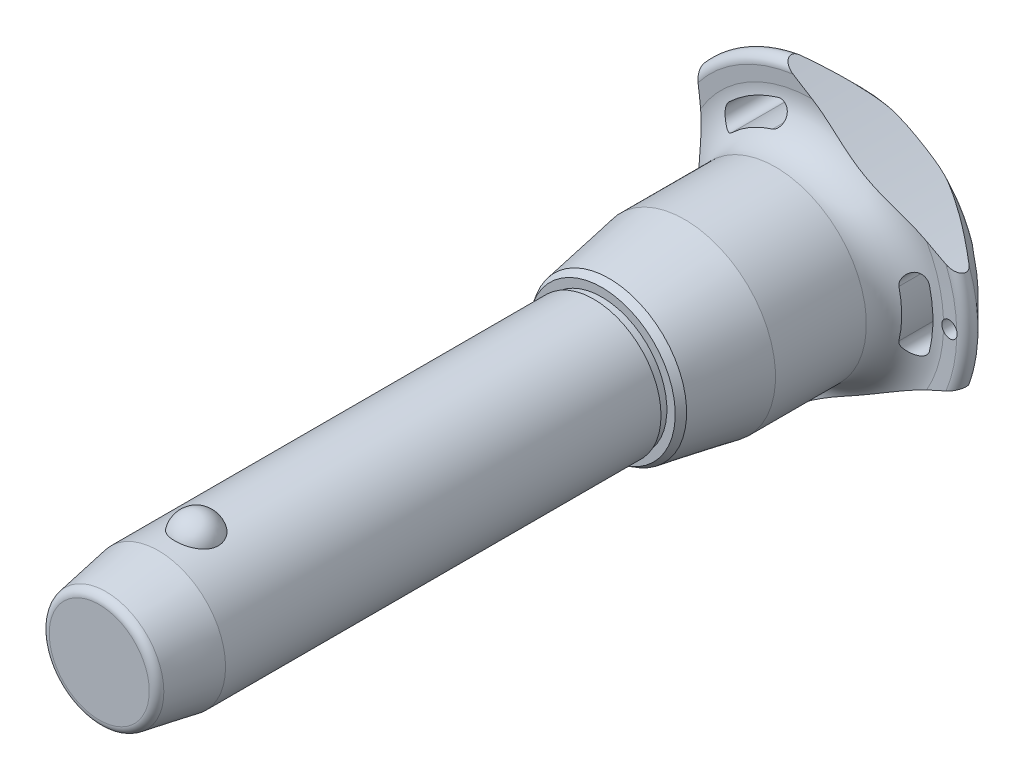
from build123d import *

# Parameters (mm, degrees)
SKETCH1_R           = 12.5
BOSS_EXTRUDE1_DEPTH = 70
SKETCH2_R           = 10
BOSS_EXTRUDE2_DEPTH = 50.7
BOSS_EXTRUDE3_START = 22
SKETCH1_2_R         = 12.5
BOSS_EXTRUDE3_DEPTH = 22
CHAMFER1_SIZE       = 11
CHAMFER1_SIZE2      = 1.939596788
FILLET1_R           = 1.5
SKETCH6_R           = 176.92625
CUT_EXTRUDE1_DEPTH  = 128.274554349
CIRPATTERN1_COUNT   = 3
SKETCH7_R           = 1.5
CUT_EXTRUDE2_DEPTH  = 128.154892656


with BuildPart() as part:
    # Sketch1 → Boss-Extrude1 (new body)
    with BuildSketch(Plane.XY):
        Circle(SKETCH1_R)
    extrude(amount=-BOSS_EXTRUDE1_DEPTH)

    # Sketch2 → Boss-Extrude2 (add)
    with BuildSketch(Plane(origin=(0, 0, -70), x_dir=(-1, 0, 0), z_dir=(0, 0, -1))):
        with Locations(Location((0, 0, 0), (0, 0, 180))):
            Circle(SKETCH2_R)
    extrude(amount=BOSS_EXTRUDE2_DEPTH)

    # Sketch3 → Revolve1 (revolve)
    with BuildSketch(Plane(origin=(0, 0, 0), x_dir=(0, 0, -1), z_dir=(1, 0, 0))):
        with BuildLine():
            Line((-3.957271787, 15.4), (-3.957271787, 7.1))
            ThreePointArc((-3.957271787, 7.1), (0.192728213, 11.25), (-3.957271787, 15.4))
        make_face()
        with BuildLine():
            Line((-3.957271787, -7.1), (-3.957271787, -15.4))
            ThreePointArc((-3.957271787, -15.4), (0.192728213, -11.25), (-3.957271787, -7.1))
        make_face()
    revolve(axis=Axis((0, -7.1, 3.957271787), (0, 1, 0)))

    # Sketch1_2 → Boss-Extrude3 (add)
    with BuildSketch(Plane.XY.offset(BOSS_EXTRUDE3_START)):
        Circle(SKETCH1_2_R)
    extrude(amount=-BOSS_EXTRUDE3_DEPTH)

    # Chamfer1
    chamfer1_edges = [part.edges().sort_by_distance(p)[0] for p in [
        (-12.5, 0, 22),
    ]]
    chamfer1_side = [part.faces().sort_by_distance(p)[0] for p in [
        (-12.5, 0, -24),
    ]]
    chamfer(chamfer1_edges, length=CHAMFER1_SIZE, length2=CHAMFER1_SIZE2, reference=chamfer1_side[0])

    # Fillet1
    fillet1_edges = [part.edges().sort_by_distance(p)[0] for p in [
        (-10.560403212, 0, 22),
        (-10, 0, -120.7),
    ]]
    fillet(fillet1_edges, radius=FILLET1_R)

    # Sketch4 → Revolve2 (revolve)
    with BuildSketch(Plane(origin=(0, 0, 0), x_dir=(0, 0, -1), z_dir=(1, 0, 0)), mode=Mode.PRIVATE) as revolve2_sk:
        Polygon((70, 0), (70, 12.089202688), (71.5, 12.089202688), (71.5, 13.644437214), (72.846872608, 14.422054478), (86.9, 16.9), (103.8, 16.9), (103.8, 0), align=None)
    revolve(revolve2_sk.sketch.rotate(Axis((0, 0, -103.8), (0, 0, 1)), 90), axis=Axis((0, 0, -103.8), (0, 0, 1)))

    # Sketch5 → Revolve3 (revolve)
    with BuildSketch(Plane(origin=(0, 0, 0), x_dir=(0, 0, -1), z_dir=(1, 0, 0)), mode=Mode.PRIVATE) as revolve3_sk:
        with BuildLine():
            Line((110.790129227, 24.271609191), (110.652256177, 26.865060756))
            ThreePointArc((110.652256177, 26.865060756), (111.598671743, 28.411427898), (113.38137085, 28.08137085))
            Line((113.38137085, 28.08137085), (119.763226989, 21.69951471))
            ThreePointArc((119.763226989, 21.69951471), (120.7, 19.381044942), (119.683055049, 17.096604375))
            ThreePointArc((119.683055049, 17.096604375), (114.18864484, 9.321268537), (112.25, 0))
            Line((112.25, 0), (103.8, 0))
            Line((103.8, 0), (103.8, 16.9))
            ThreePointArc((103.8, 16.9), (108.879432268, 19.083427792), (110.790129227, 24.271609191))
        make_face()
    revolve(revolve3_sk.sketch.rotate(Axis((0, 0, -112.25), (0, 0, 1)), 90), axis=Axis((0, 0, -112.25), (0, 0, 1)))

    # Sketch6 → Cut-Extrude1 (cut, through all)
    with BuildSketch(Plane.XY):
        with Locations((-197.42625, 0)):
            Circle(SKETCH6_R)
        with BuildLine():
            ThreePointArc((21.802992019, -5.260839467), (22.428706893, 0), (21.802992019, 5.260839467))
            ThreePointArc((21.802992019, 5.260839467), (19.579234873, 6.620060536), (18.220013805, 4.39630339))
            ThreePointArc((18.220013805, 4.39630339), (18.742902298, 0), (18.220013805, -4.39630339))
            ThreePointArc((18.220013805, -4.39630339), (19.579234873, -6.620060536), (21.802992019, -5.260839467))
        make_face()
    cut_extrude1 = extrude(amount=-CUT_EXTRUDE1_DEPTH, mode=Mode.SUBTRACT)

    # CirPattern1: Cut-Extrude1 ×3 about axis
    cirpattern1_axis = Axis((0, 0, 0), (0, 0, 1))
    for i in range(1, CIRPATTERN1_COUNT):
        add(cut_extrude1.rotate(cirpattern1_axis, i * 360 / CIRPATTERN1_COUNT), mode=Mode.SUBTRACT)

    # Sketch7 → Cut-Extrude2 (cut, through all)
    with BuildSketch(Plane.XY):
        with Locations(Location((25.428706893, 0, 0), (0, 0, 17.230769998))):
            Circle(SKETCH7_R)
    extrude(amount=-CUT_EXTRUDE2_DEPTH, mode=Mode.SUBTRACT)


solid = part.part
